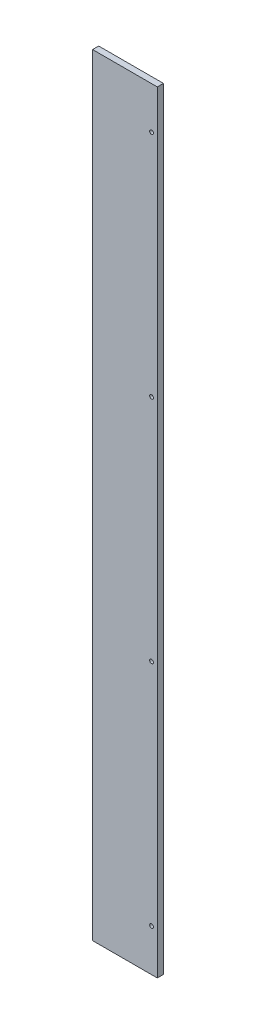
ISO-10303-21;
HEADER;
FILE_DESCRIPTION(('STEP AP214'),'2;1');
FILE_NAME('part.step','',(''),(''),'','','');
FILE_SCHEMA(('AUTOMOTIVE_DESIGN { 1 0 10303 214 1 1 1 1 }'));
ENDSEC;
DATA;
#1=APPLICATION_CONTEXT('core data for automotive mechanical design processes');
#2=APPLICATION_PROTOCOL_DEFINITION('international standard','automotive_design',2000,#1);
#3=PRODUCT_CONTEXT('',#1,'mechanical');
#4=PRODUCT('Part','Part','',(#3));
#5=PRODUCT_RELATED_PRODUCT_CATEGORY('part','',(#4));
#6=PRODUCT_DEFINITION_FORMATION('','',#4);
#7=PRODUCT_DEFINITION_CONTEXT('part definition',#1,'design');
#8=PRODUCT_DEFINITION('design','',#6,#7);
#9=PRODUCT_DEFINITION_SHAPE('','',#8);
#10=(LENGTH_UNIT() NAMED_UNIT(*) SI_UNIT(.MILLI.,.METRE.));
#11=(NAMED_UNIT(*) PLANE_ANGLE_UNIT() SI_UNIT($,.RADIAN.));
#12=(NAMED_UNIT(*) SI_UNIT($,.STERADIAN.) SOLID_ANGLE_UNIT());
#13=UNCERTAINTY_MEASURE_WITH_UNIT(LENGTH_MEASURE(1.E-05),#10,'distance_accuracy_value','');
#14=(GEOMETRIC_REPRESENTATION_CONTEXT(3) GLOBAL_UNCERTAINTY_ASSIGNED_CONTEXT((#13)) GLOBAL_UNIT_ASSIGNED_CONTEXT((#10,
#11,#12)) REPRESENTATION_CONTEXT('',''));
#15=CARTESIAN_POINT('',(0.,0.,0.));
#16=DIRECTION('',(0.,0.,1.));
#17=DIRECTION('',(1.,0.,0.));
#18=AXIS2_PLACEMENT_3D('',#15,#16,#17);
#19=CARTESIAN_POINT('',(-84.5000000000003,1007.5,8.));
#20=DIRECTION('',(1.,0.,0.));
#21=DIRECTION('',(0.,0.,-1.));
#22=AXIS2_PLACEMENT_3D('',#19,#20,#21);
#23=PLANE('',#22);
#24=DIRECTION('',(0.,-1.,0.));
#25=VECTOR('',#24,1.);
#26=CARTESIAN_POINT('',(-84.5000000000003,1007.5,-8.));
#27=LINE('',#26,#25);
#28=CARTESIAN_POINT('',(-84.5000000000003,1007.5,-8.));
#29=VERTEX_POINT('',#28);
#30=CARTESIAN_POINT('',(-84.5000000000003,-1007.5,-8.));
#31=VERTEX_POINT('',#30);
#32=EDGE_CURVE('E115',#29,#31,#27,.T.);
#33=ORIENTED_EDGE('',*,*,#32,.T.);
#34=DIRECTION('',(0.,0.,-1.));
#35=VECTOR('',#34,1.);
#36=CARTESIAN_POINT('',(-84.5000000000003,-1007.5,8.));
#37=LINE('',#36,#35);
#38=CARTESIAN_POINT('',(-84.5000000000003,-1007.5,8.));
#39=VERTEX_POINT('',#38);
#40=EDGE_CURVE('E11',#39,#31,#37,.T.);
#41=ORIENTED_EDGE('',*,*,#40,.F.);
#42=DIRECTION('',(0.,-1.,0.));
#43=VECTOR('',#42,1.);
#44=CARTESIAN_POINT('',(-84.5000000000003,1007.5,8.));
#45=LINE('',#44,#43);
#46=CARTESIAN_POINT('',(-84.5000000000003,1007.5,8.));
#47=VERTEX_POINT('',#46);
#48=EDGE_CURVE('E97',#47,#39,#45,.T.);
#49=ORIENTED_EDGE('',*,*,#48,.F.);
#50=DIRECTION('',(0.,0.,-1.));
#51=VECTOR('',#50,1.);
#52=CARTESIAN_POINT('',(-84.5000000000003,1007.5,8.));
#53=LINE('',#52,#51);
#54=EDGE_CURVE('E111',#47,#29,#53,.T.);
#55=ORIENTED_EDGE('',*,*,#54,.T.);
#56=EDGE_LOOP('',(#33,#41,#49,#55));
#57=FACE_BOUND('',#56,.T.);
#58=ADVANCED_FACE('F45',(#57),#23,.F.);
#59=CARTESIAN_POINT('',(-84.5000000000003,-1007.5,8.));
#60=DIRECTION('',(0.,1.,0.));
#61=DIRECTION('',(0.,0.,1.));
#62=AXIS2_PLACEMENT_3D('',#59,#60,#61);
#63=PLANE('',#62);
#64=DIRECTION('',(1.,0.,0.));
#65=VECTOR('',#64,1.);
#66=CARTESIAN_POINT('',(-84.5000000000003,-1007.5,-8.));
#67=LINE('',#66,#65);
#68=CARTESIAN_POINT('',(84.5000000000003,-1007.5,-8.));
#69=VERTEX_POINT('',#68);
#70=EDGE_CURVE('E102',#31,#69,#67,.T.);
#71=ORIENTED_EDGE('',*,*,#70,.T.);
#72=DIRECTION('',(0.,0.,-1.));
#73=VECTOR('',#72,1.);
#74=CARTESIAN_POINT('',(84.5000000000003,-1007.5,8.));
#75=LINE('',#74,#73);
#76=CARTESIAN_POINT('',(84.5000000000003,-1007.5,8.));
#77=VERTEX_POINT('',#76);
#78=EDGE_CURVE('E54',#77,#69,#75,.T.);
#79=ORIENTED_EDGE('',*,*,#78,.F.);
#80=DIRECTION('',(1.,0.,0.));
#81=VECTOR('',#80,1.);
#82=CARTESIAN_POINT('',(-84.5000000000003,-1007.5,8.));
#83=LINE('',#82,#81);
#84=EDGE_CURVE('E92',#39,#77,#83,.T.);
#85=ORIENTED_EDGE('',*,*,#84,.F.);
#86=ORIENTED_EDGE('',*,*,#40,.T.);
#87=EDGE_LOOP('',(#71,#79,#85,#86));
#88=FACE_BOUND('',#87,.T.);
#89=ADVANCED_FACE('F101',(#88),#63,.F.);
#90=CARTESIAN_POINT('',(84.5000000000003,1007.5,8.));
#91=DIRECTION('',(-1.,0.,0.));
#92=DIRECTION('',(0.,0.,1.));
#93=AXIS2_PLACEMENT_3D('',#90,#91,#92);
#94=PLANE('',#93);
#95=DIRECTION('',(0.,1.,0.));
#96=VECTOR('',#95,1.);
#97=CARTESIAN_POINT('',(84.5000000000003,1007.5,-8.));
#98=LINE('',#97,#96);
#99=CARTESIAN_POINT('',(84.5000000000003,1007.5,-8.));
#100=VERTEX_POINT('',#99);
#101=EDGE_CURVE('E79',#69,#100,#98,.T.);
#102=ORIENTED_EDGE('',*,*,#101,.T.);
#103=DIRECTION('',(0.,0.,-1.));
#104=VECTOR('',#103,1.);
#105=CARTESIAN_POINT('',(84.5000000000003,1007.5,8.));
#106=LINE('',#105,#104);
#107=CARTESIAN_POINT('',(84.5000000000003,1007.5,8.));
#108=VERTEX_POINT('',#107);
#109=EDGE_CURVE('E104',#108,#100,#106,.T.);
#110=ORIENTED_EDGE('',*,*,#109,.F.);
#111=DIRECTION('',(0.,1.,0.));
#112=VECTOR('',#111,1.);
#113=CARTESIAN_POINT('',(84.5000000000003,1007.5,8.));
#114=LINE('',#113,#112);
#115=EDGE_CURVE('E95',#77,#108,#114,.T.);
#116=ORIENTED_EDGE('',*,*,#115,.F.);
#117=ORIENTED_EDGE('',*,*,#78,.T.);
#118=EDGE_LOOP('',(#102,#110,#116,#117));
#119=FACE_BOUND('',#118,.T.);
#120=ADVANCED_FACE('F105',(#119),#94,.F.);
#121=CARTESIAN_POINT('',(-84.5000000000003,1007.5,8.));
#122=DIRECTION('',(0.,-1.,0.));
#123=DIRECTION('',(0.,0.,-1.));
#124=AXIS2_PLACEMENT_3D('',#121,#122,#123);
#125=PLANE('',#124);
#126=DIRECTION('',(-1.,0.,0.));
#127=VECTOR('',#126,1.);
#128=CARTESIAN_POINT('',(-84.5000000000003,1007.5,-8.));
#129=LINE('',#128,#127);
#130=EDGE_CURVE('E85',#100,#29,#129,.T.);
#131=ORIENTED_EDGE('',*,*,#130,.T.);
#132=ORIENTED_EDGE('',*,*,#54,.F.);
#133=DIRECTION('',(-1.,0.,0.));
#134=VECTOR('',#133,1.);
#135=CARTESIAN_POINT('',(-84.5000000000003,1007.5,8.));
#136=LINE('',#135,#134);
#137=EDGE_CURVE('E62',#108,#47,#136,.T.);
#138=ORIENTED_EDGE('',*,*,#137,.F.);
#139=ORIENTED_EDGE('',*,*,#109,.T.);
#140=EDGE_LOOP('',(#131,#132,#138,#139));
#141=FACE_BOUND('',#140,.T.);
#142=ADVANCED_FACE('F130',(#141),#125,.F.);
#143=CARTESIAN_POINT('',(0.,0.,8.));
#144=DIRECTION('',(0.,0.,1.));
#145=DIRECTION('',(1.,0.,0.));
#146=AXIS2_PLACEMENT_3D('',#143,#144,#145);
#147=PLANE('',#146);
#148=CARTESIAN_POINT('',(69.4999999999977,-897.5,8.));
#149=DIRECTION('',(0.,0.,1.));
#150=DIRECTION('',(1.,0.,0.));
#151=AXIS2_PLACEMENT_3D('',#148,#149,#150);
#152=CIRCLE('',#151,5.00000000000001);
#153=CARTESIAN_POINT('',(74.4999999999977,-897.5,8.));
#154=VERTEX_POINT('',#153);
#155=EDGE_CURVE('E163',#154,#154,#152,.T.);
#156=ORIENTED_EDGE('',*,*,#155,.F.);
#157=EDGE_LOOP('',(#156));
#158=FACE_BOUND('',#157,.T.);
#159=CARTESIAN_POINT('',(69.4999999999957,-299.166666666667,8.));
#160=DIRECTION('',(0.,0.,1.));
#161=DIRECTION('',(1.,0.,0.));
#162=AXIS2_PLACEMENT_3D('',#159,#160,#161);
#163=CIRCLE('',#162,5.00000000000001);
#164=CARTESIAN_POINT('',(74.4999999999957,-299.166666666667,8.));
#165=VERTEX_POINT('',#164);
#166=EDGE_CURVE('E155',#165,#165,#163,.T.);
#167=ORIENTED_EDGE('',*,*,#166,.F.);
#168=EDGE_LOOP('',(#167));
#169=FACE_BOUND('',#168,.T.);
#170=CARTESIAN_POINT('',(69.4999999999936,299.166666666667,8.));
#171=DIRECTION('',(0.,0.,1.));
#172=DIRECTION('',(1.,0.,0.));
#173=AXIS2_PLACEMENT_3D('',#170,#171,#172);
#174=CIRCLE('',#173,5.00000000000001);
#175=CARTESIAN_POINT('',(74.4999999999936,299.166666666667,8.));
#176=VERTEX_POINT('',#175);
#177=EDGE_CURVE('E147',#176,#176,#174,.T.);
#178=ORIENTED_EDGE('',*,*,#177,.F.);
#179=EDGE_LOOP('',(#178));
#180=FACE_BOUND('',#179,.T.);
#181=CARTESIAN_POINT('',(69.4999999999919,897.5,8.));
#182=DIRECTION('',(0.,0.,1.));
#183=DIRECTION('',(1.,0.,0.));
#184=AXIS2_PLACEMENT_3D('',#181,#182,#183);
#185=CIRCLE('',#184,5.00000000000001);
#186=CARTESIAN_POINT('',(74.4999999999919,897.5,8.));
#187=VERTEX_POINT('',#186);
#188=EDGE_CURVE('E139',#187,#187,#185,.T.);
#189=ORIENTED_EDGE('',*,*,#188,.F.);
#190=EDGE_LOOP('',(#189));
#191=FACE_BOUND('',#190,.T.);
#192=ORIENTED_EDGE('',*,*,#48,.T.);
#193=ORIENTED_EDGE('',*,*,#84,.T.);
#194=ORIENTED_EDGE('',*,*,#115,.T.);
#195=ORIENTED_EDGE('',*,*,#137,.T.);
#196=EDGE_LOOP('',(#192,#193,#194,#195));
#197=FACE_BOUND('',#196,.T.);
#198=ADVANCED_FACE('F93',(#158,#169,#180,#191,#197),#147,.T.);
#199=CARTESIAN_POINT('',(0.,0.,-8.));
#200=DIRECTION('',(0.,0.,1.));
#201=DIRECTION('',(1.,0.,0.));
#202=AXIS2_PLACEMENT_3D('',#199,#200,#201);
#203=PLANE('',#202);
#204=CARTESIAN_POINT('',(69.4999999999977,-897.5,-8.));
#205=DIRECTION('',(0.,0.,1.));
#206=DIRECTION('',(1.,0.,0.));
#207=AXIS2_PLACEMENT_3D('',#204,#205,#206);
#208=CIRCLE('',#207,5.00000000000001);
#209=CARTESIAN_POINT('',(74.4999999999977,-897.5,-8.));
#210=VERTEX_POINT('',#209);
#211=EDGE_CURVE('E119',#210,#210,#208,.T.);
#212=ORIENTED_EDGE('',*,*,#211,.T.);
#213=EDGE_LOOP('',(#212));
#214=FACE_BOUND('',#213,.T.);
#215=CARTESIAN_POINT('',(69.4999999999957,-299.166666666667,-8.));
#216=DIRECTION('',(0.,0.,1.));
#217=DIRECTION('',(1.,0.,0.));
#218=AXIS2_PLACEMENT_3D('',#215,#216,#217);
#219=CIRCLE('',#218,5.00000000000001);
#220=CARTESIAN_POINT('',(74.4999999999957,-299.166666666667,-8.));
#221=VERTEX_POINT('',#220);
#222=EDGE_CURVE('E159',#221,#221,#219,.T.);
#223=ORIENTED_EDGE('',*,*,#222,.T.);
#224=EDGE_LOOP('',(#223));
#225=FACE_BOUND('',#224,.T.);
#226=CARTESIAN_POINT('',(69.4999999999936,299.166666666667,-8.));
#227=DIRECTION('',(0.,0.,1.));
#228=DIRECTION('',(1.,0.,0.));
#229=AXIS2_PLACEMENT_3D('',#226,#227,#228);
#230=CIRCLE('',#229,5.00000000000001);
#231=CARTESIAN_POINT('',(74.4999999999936,299.166666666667,-8.));
#232=VERTEX_POINT('',#231);
#233=EDGE_CURVE('E151',#232,#232,#230,.T.);
#234=ORIENTED_EDGE('',*,*,#233,.T.);
#235=EDGE_LOOP('',(#234));
#236=FACE_BOUND('',#235,.T.);
#237=CARTESIAN_POINT('',(69.4999999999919,897.5,-8.));
#238=DIRECTION('',(0.,0.,1.));
#239=DIRECTION('',(1.,0.,0.));
#240=AXIS2_PLACEMENT_3D('',#237,#238,#239);
#241=CIRCLE('',#240,5.00000000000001);
#242=CARTESIAN_POINT('',(74.4999999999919,897.5,-8.));
#243=VERTEX_POINT('',#242);
#244=EDGE_CURVE('E143',#243,#243,#241,.T.);
#245=ORIENTED_EDGE('',*,*,#244,.T.);
#246=EDGE_LOOP('',(#245));
#247=FACE_BOUND('',#246,.T.);
#248=ORIENTED_EDGE('',*,*,#32,.F.);
#249=ORIENTED_EDGE('',*,*,#130,.F.);
#250=ORIENTED_EDGE('',*,*,#101,.F.);
#251=ORIENTED_EDGE('',*,*,#70,.F.);
#252=EDGE_LOOP('',(#248,#249,#250,#251));
#253=FACE_BOUND('',#252,.T.);
#254=ADVANCED_FACE('F133',(#214,#225,#236,#247,#253),#203,.F.);
#255=CARTESIAN_POINT('',(69.4999999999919,897.5,-8.));
#256=DIRECTION('',(0.,0.,1.));
#257=DIRECTION('',(1.,0.,0.));
#258=AXIS2_PLACEMENT_3D('',#255,#256,#257);
#259=CYLINDRICAL_SURFACE('',#258,5.00000000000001);
#260=ORIENTED_EDGE('',*,*,#244,.F.);
#261=EDGE_LOOP('',(#260));
#262=FACE_BOUND('',#261,.T.);
#263=ORIENTED_EDGE('',*,*,#188,.T.);
#264=EDGE_LOOP('',(#263));
#265=FACE_BOUND('',#264,.T.);
#266=ADVANCED_FACE('F190',(#262,#265),#259,.F.);
#267=CARTESIAN_POINT('',(69.4999999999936,299.166666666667,-8.));
#268=DIRECTION('',(0.,0.,1.));
#269=DIRECTION('',(1.,0.,0.));
#270=AXIS2_PLACEMENT_3D('',#267,#268,#269);
#271=CYLINDRICAL_SURFACE('',#270,5.00000000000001);
#272=ORIENTED_EDGE('',*,*,#233,.F.);
#273=EDGE_LOOP('',(#272));
#274=FACE_BOUND('',#273,.T.);
#275=ORIENTED_EDGE('',*,*,#177,.T.);
#276=EDGE_LOOP('',(#275));
#277=FACE_BOUND('',#276,.T.);
#278=ADVANCED_FACE('F192',(#274,#277),#271,.F.);
#279=CARTESIAN_POINT('',(69.4999999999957,-299.166666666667,-8.));
#280=DIRECTION('',(0.,0.,1.));
#281=DIRECTION('',(1.,0.,0.));
#282=AXIS2_PLACEMENT_3D('',#279,#280,#281);
#283=CYLINDRICAL_SURFACE('',#282,5.00000000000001);
#284=ORIENTED_EDGE('',*,*,#222,.F.);
#285=EDGE_LOOP('',(#284));
#286=FACE_BOUND('',#285,.T.);
#287=ORIENTED_EDGE('',*,*,#166,.T.);
#288=EDGE_LOOP('',(#287));
#289=FACE_BOUND('',#288,.T.);
#290=ADVANCED_FACE('F177',(#286,#289),#283,.F.);
#291=CARTESIAN_POINT('',(69.4999999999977,-897.5,-8.));
#292=DIRECTION('',(0.,0.,1.));
#293=DIRECTION('',(1.,0.,0.));
#294=AXIS2_PLACEMENT_3D('',#291,#292,#293);
#295=CYLINDRICAL_SURFACE('',#294,5.00000000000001);
#296=ORIENTED_EDGE('',*,*,#211,.F.);
#297=EDGE_LOOP('',(#296));
#298=FACE_BOUND('',#297,.T.);
#299=ORIENTED_EDGE('',*,*,#155,.T.);
#300=EDGE_LOOP('',(#299));
#301=FACE_BOUND('',#300,.T.);
#302=ADVANCED_FACE('F174',(#298,#301),#295,.F.);
#303=CLOSED_SHELL('',(#58,#89,#120,#142,#198,#254,#266,#278,#290,#302));
#304=MANIFOLD_SOLID_BREP('B2',#303);
#305=ADVANCED_BREP_SHAPE_REPRESENTATION('',(#18,#304),#14);
#306=SHAPE_DEFINITION_REPRESENTATION(#9,#305);
ENDSEC;
END-ISO-10303-21;
